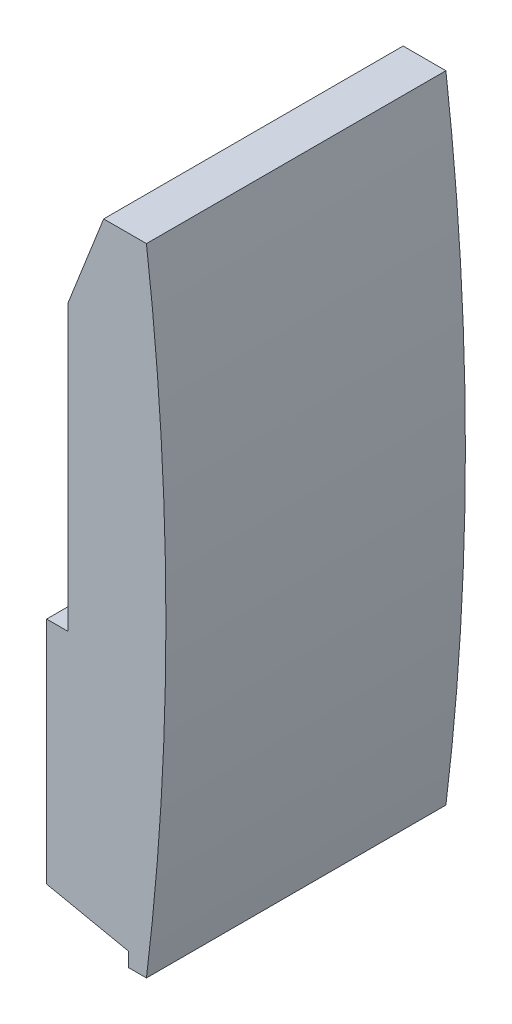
ISO-10303-21;
HEADER;
FILE_DESCRIPTION(('STEP AP214'),'2;1');
FILE_NAME('part.step','',(''),(''),'','','');
FILE_SCHEMA(('AUTOMOTIVE_DESIGN { 1 0 10303 214 1 1 1 1 }'));
ENDSEC;
DATA;
#1=APPLICATION_CONTEXT('core data for automotive mechanical design processes');
#2=APPLICATION_PROTOCOL_DEFINITION('international standard','automotive_design',2000,#1);
#3=PRODUCT_CONTEXT('',#1,'mechanical');
#4=PRODUCT('Part','Part','',(#3));
#5=PRODUCT_RELATED_PRODUCT_CATEGORY('part','',(#4));
#6=PRODUCT_DEFINITION_FORMATION('','',#4);
#7=PRODUCT_DEFINITION_CONTEXT('part definition',#1,'design');
#8=PRODUCT_DEFINITION('design','',#6,#7);
#9=PRODUCT_DEFINITION_SHAPE('','',#8);
#10=(LENGTH_UNIT() NAMED_UNIT(*) SI_UNIT(.MILLI.,.METRE.));
#11=(NAMED_UNIT(*) PLANE_ANGLE_UNIT() SI_UNIT($,.RADIAN.));
#12=(NAMED_UNIT(*) SI_UNIT($,.STERADIAN.) SOLID_ANGLE_UNIT());
#13=UNCERTAINTY_MEASURE_WITH_UNIT(LENGTH_MEASURE(1.E-05),#10,'distance_accuracy_value','');
#14=(GEOMETRIC_REPRESENTATION_CONTEXT(3) GLOBAL_UNCERTAINTY_ASSIGNED_CONTEXT((#13)) GLOBAL_UNIT_ASSIGNED_CONTEXT((#10,
#11,#12)) REPRESENTATION_CONTEXT('',''));
#15=CARTESIAN_POINT('',(0.,0.,0.));
#16=DIRECTION('',(0.,0.,1.));
#17=DIRECTION('',(1.,0.,0.));
#18=AXIS2_PLACEMENT_3D('',#15,#16,#17);
#19=CARTESIAN_POINT('',(349.,-40.2,21.));
#20=DIRECTION('',(1.,0.,0.));
#21=DIRECTION('',(0.,0.,-1.));
#22=AXIS2_PLACEMENT_3D('',#19,#20,#21);
#23=PLANE('',#22);
#24=DIRECTION('',(0.,-1.,0.));
#25=VECTOR('',#24,1.);
#26=CARTESIAN_POINT('',(349.,-40.2,-21.));
#27=LINE('',#26,#25);
#28=CARTESIAN_POINT('',(349.,-8.,-21.));
#29=VERTEX_POINT('',#28);
#30=CARTESIAN_POINT('',(349.,-40.2,-21.));
#31=VERTEX_POINT('',#30);
#32=EDGE_CURVE('E141',#29,#31,#27,.T.);
#33=ORIENTED_EDGE('',*,*,#32,.T.);
#34=DIRECTION('',(0.,0.,-1.));
#35=VECTOR('',#34,1.);
#36=CARTESIAN_POINT('',(349.,-40.2,21.));
#37=LINE('',#36,#35);
#38=CARTESIAN_POINT('',(349.,-40.2,21.));
#39=VERTEX_POINT('',#38);
#40=EDGE_CURVE('E11',#39,#31,#37,.T.);
#41=ORIENTED_EDGE('',*,*,#40,.F.);
#42=DIRECTION('',(0.,-1.,0.));
#43=VECTOR('',#42,1.);
#44=CARTESIAN_POINT('',(349.,-40.2,21.));
#45=LINE('',#44,#43);
#46=CARTESIAN_POINT('',(349.,-8.,21.));
#47=VERTEX_POINT('',#46);
#48=EDGE_CURVE('E157',#47,#39,#45,.T.);
#49=ORIENTED_EDGE('',*,*,#48,.F.);
#50=DIRECTION('',(0.,0.,-1.));
#51=VECTOR('',#50,1.);
#52=CARTESIAN_POINT('',(349.,-8.,21.));
#53=LINE('',#52,#51);
#54=EDGE_CURVE('E137',#47,#29,#53,.T.);
#55=ORIENTED_EDGE('',*,*,#54,.T.);
#56=EDGE_LOOP('',(#33,#41,#49,#55));
#57=FACE_BOUND('',#56,.T.);
#58=ADVANCED_FACE('F39',(#57),#23,.F.);
#59=CARTESIAN_POINT('',(349.,-40.2,21.));
#60=DIRECTION('',(0.204294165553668,0.978909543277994,0.));
#61=DIRECTION('',(-0.978909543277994,0.204294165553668,0.));
#62=AXIS2_PLACEMENT_3D('',#59,#60,#61);
#63=PLANE('',#62);
#64=DIRECTION('',(0.978909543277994,-0.204294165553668,0.));
#65=VECTOR('',#64,1.);
#66=CARTESIAN_POINT('',(349.,-40.2,-21.));
#67=LINE('',#66,#65);
#68=CARTESIAN_POINT('',(360.5,-42.6,-21.));
#69=VERTEX_POINT('',#68);
#70=EDGE_CURVE('E144',#31,#69,#67,.T.);
#71=ORIENTED_EDGE('',*,*,#70,.T.);
#72=DIRECTION('',(0.,0.,-1.));
#73=VECTOR('',#72,1.);
#74=CARTESIAN_POINT('',(360.5,-42.6,21.));
#75=LINE('',#74,#73);
#76=CARTESIAN_POINT('',(360.5,-42.6,21.));
#77=VERTEX_POINT('',#76);
#78=EDGE_CURVE('E47',#77,#69,#75,.T.);
#79=ORIENTED_EDGE('',*,*,#78,.F.);
#80=DIRECTION('',(0.978909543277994,-0.204294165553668,0.));
#81=VECTOR('',#80,1.);
#82=CARTESIAN_POINT('',(349.,-40.2,21.));
#83=LINE('',#82,#81);
#84=EDGE_CURVE('E101',#39,#77,#83,.T.);
#85=ORIENTED_EDGE('',*,*,#84,.F.);
#86=ORIENTED_EDGE('',*,*,#40,.T.);
#87=EDGE_LOOP('',(#71,#79,#85,#86));
#88=FACE_BOUND('',#87,.T.);
#89=ADVANCED_FACE('F200',(#88),#63,.F.);
#90=CARTESIAN_POINT('',(360.5,-42.6,21.));
#91=DIRECTION('',(1.,0.,0.));
#92=DIRECTION('',(0.,0.,-1.));
#93=AXIS2_PLACEMENT_3D('',#90,#91,#92);
#94=PLANE('',#93);
#95=DIRECTION('',(0.,-1.,0.));
#96=VECTOR('',#95,1.);
#97=CARTESIAN_POINT('',(360.5,-42.6,-21.));
#98=LINE('',#97,#96);
#99=CARTESIAN_POINT('',(360.5,-44.6,-21.));
#100=VERTEX_POINT('',#99);
#101=EDGE_CURVE('E146',#69,#100,#98,.T.);
#102=ORIENTED_EDGE('',*,*,#101,.T.);
#103=DIRECTION('',(0.,0.,-1.));
#104=VECTOR('',#103,1.);
#105=CARTESIAN_POINT('',(360.5,-44.6,21.));
#106=LINE('',#105,#104);
#107=CARTESIAN_POINT('',(360.5,-44.6,21.));
#108=VERTEX_POINT('',#107);
#109=EDGE_CURVE('E167',#108,#100,#106,.T.);
#110=ORIENTED_EDGE('',*,*,#109,.F.);
#111=DIRECTION('',(0.,-1.,0.));
#112=VECTOR('',#111,1.);
#113=CARTESIAN_POINT('',(360.5,-42.6,21.));
#114=LINE('',#113,#112);
#115=EDGE_CURVE('E175',#77,#108,#114,.T.);
#116=ORIENTED_EDGE('',*,*,#115,.F.);
#117=ORIENTED_EDGE('',*,*,#78,.T.);
#118=EDGE_LOOP('',(#102,#110,#116,#117));
#119=FACE_BOUND('',#118,.T.);
#120=ADVANCED_FACE('F173',(#119),#94,.F.);
#121=CARTESIAN_POINT('',(360.5,-44.6,21.));
#122=DIRECTION('',(0.,1.,0.));
#123=DIRECTION('',(0.,0.,1.));
#124=AXIS2_PLACEMENT_3D('',#121,#122,#123);
#125=PLANE('',#124);
#126=DIRECTION('',(1.,0.,0.));
#127=VECTOR('',#126,1.);
#128=CARTESIAN_POINT('',(360.5,-44.6,-21.));
#129=LINE('',#128,#127);
#130=CARTESIAN_POINT('',(363.,-44.6,-21.));
#131=VERTEX_POINT('',#130);
#132=EDGE_CURVE('E148',#100,#131,#129,.T.);
#133=ORIENTED_EDGE('',*,*,#132,.T.);
#134=DIRECTION('',(0.,0.,-1.));
#135=VECTOR('',#134,1.);
#136=CARTESIAN_POINT('',(363.,-44.6,21.));
#137=LINE('',#136,#135);
#138=CARTESIAN_POINT('',(363.,-44.6,21.));
#139=VERTEX_POINT('',#138);
#140=EDGE_CURVE('E164',#139,#131,#137,.T.);
#141=ORIENTED_EDGE('',*,*,#140,.F.);
#142=DIRECTION('',(1.,0.,0.));
#143=VECTOR('',#142,1.);
#144=CARTESIAN_POINT('',(360.5,-44.6,21.));
#145=LINE('',#144,#143);
#146=EDGE_CURVE('E191',#108,#139,#145,.T.);
#147=ORIENTED_EDGE('',*,*,#146,.F.);
#148=ORIENTED_EDGE('',*,*,#109,.T.);
#149=EDGE_LOOP('',(#133,#141,#147,#148));
#150=FACE_BOUND('',#149,.T.);
#151=ADVANCED_FACE('F184',(#150),#125,.F.);
#152=CARTESIAN_POINT('',(0.,0.,21.));
#153=DIRECTION('',(0.,0.,-1.));
#154=DIRECTION('',(-1.,0.,0.));
#155=AXIS2_PLACEMENT_3D('',#152,#153,#154);
#156=CYLINDRICAL_SURFACE('',#155,365.729626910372);
#157=CARTESIAN_POINT('',(0.,0.,-21.));
#158=DIRECTION('',(0.,0.,1.));
#159=DIRECTION('',(-1.,0.,0.));
#160=AXIS2_PLACEMENT_3D('',#157,#158,#159);
#161=CIRCLE('',#160,365.729626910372);
#162=CARTESIAN_POINT('',(363.,44.6000000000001,-21.));
#163=VERTEX_POINT('',#162);
#164=EDGE_CURVE('E150',#131,#163,#161,.T.);
#165=ORIENTED_EDGE('',*,*,#164,.T.);
#166=DIRECTION('',(0.,0.,-1.));
#167=VECTOR('',#166,1.);
#168=CARTESIAN_POINT('',(363.,44.6000000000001,21.));
#169=LINE('',#168,#167);
#170=CARTESIAN_POINT('',(363.,44.6000000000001,21.));
#171=VERTEX_POINT('',#170);
#172=EDGE_CURVE('E161',#171,#163,#169,.T.);
#173=ORIENTED_EDGE('',*,*,#172,.F.);
#174=CARTESIAN_POINT('',(0.,0.,21.));
#175=DIRECTION('',(0.,0.,1.));
#176=DIRECTION('',(-1.,0.,0.));
#177=AXIS2_PLACEMENT_3D('',#174,#175,#176);
#178=CIRCLE('',#177,365.729626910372);
#179=EDGE_CURVE('E190',#139,#171,#178,.T.);
#180=ORIENTED_EDGE('',*,*,#179,.F.);
#181=ORIENTED_EDGE('',*,*,#140,.T.);
#182=EDGE_LOOP('',(#165,#173,#180,#181));
#183=FACE_BOUND('',#182,.T.);
#184=ADVANCED_FACE('F188',(#183),#156,.T.);
#185=CARTESIAN_POINT('',(357.,44.6,21.));
#186=DIRECTION('',(0.,-1.,0.));
#187=DIRECTION('',(0.,0.,-1.));
#188=AXIS2_PLACEMENT_3D('',#185,#186,#187);
#189=PLANE('',#188);
#190=DIRECTION('',(-1.,0.,0.));
#191=VECTOR('',#190,1.);
#192=CARTESIAN_POINT('',(357.,44.6,-21.));
#193=LINE('',#192,#191);
#194=CARTESIAN_POINT('',(357.,44.6,-21.));
#195=VERTEX_POINT('',#194);
#196=EDGE_CURVE('E152',#163,#195,#193,.T.);
#197=ORIENTED_EDGE('',*,*,#196,.T.);
#198=DIRECTION('',(0.,0.,-1.));
#199=VECTOR('',#198,1.);
#200=CARTESIAN_POINT('',(357.,44.6,21.));
#201=LINE('',#200,#199);
#202=CARTESIAN_POINT('',(357.,44.6,21.));
#203=VERTEX_POINT('',#202);
#204=EDGE_CURVE('E132',#203,#195,#201,.T.);
#205=ORIENTED_EDGE('',*,*,#204,.F.);
#206=DIRECTION('',(-1.,0.,0.));
#207=VECTOR('',#206,1.);
#208=CARTESIAN_POINT('',(357.,44.6,21.));
#209=LINE('',#208,#207);
#210=EDGE_CURVE('E123',#171,#203,#209,.T.);
#211=ORIENTED_EDGE('',*,*,#210,.F.);
#212=ORIENTED_EDGE('',*,*,#172,.T.);
#213=EDGE_LOOP('',(#197,#205,#211,#212));
#214=FACE_BOUND('',#213,.T.);
#215=ADVANCED_FACE('F212',(#214),#189,.F.);
#216=CARTESIAN_POINT('',(352.,31.9,21.));
#217=DIRECTION('',(0.930484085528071,-0.366332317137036,0.));
#218=DIRECTION('',(0.366332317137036,0.930484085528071,0.));
#219=AXIS2_PLACEMENT_3D('',#216,#217,#218);
#220=PLANE('',#219);
#221=DIRECTION('',(-0.366332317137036,-0.930484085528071,0.));
#222=VECTOR('',#221,1.);
#223=CARTESIAN_POINT('',(352.,31.9,-21.));
#224=LINE('',#223,#222);
#225=CARTESIAN_POINT('',(352.,31.9,-21.));
#226=VERTEX_POINT('',#225);
#227=EDGE_CURVE('E131',#195,#226,#224,.T.);
#228=ORIENTED_EDGE('',*,*,#227,.T.);
#229=DIRECTION('',(0.,0.,-1.));
#230=VECTOR('',#229,1.);
#231=CARTESIAN_POINT('',(352.,31.9,21.));
#232=LINE('',#231,#230);
#233=CARTESIAN_POINT('',(352.,31.9,21.));
#234=VERTEX_POINT('',#233);
#235=EDGE_CURVE('E128',#234,#226,#232,.T.);
#236=ORIENTED_EDGE('',*,*,#235,.F.);
#237=DIRECTION('',(-0.366332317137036,-0.930484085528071,0.));
#238=VECTOR('',#237,1.);
#239=CARTESIAN_POINT('',(352.,31.9,21.));
#240=LINE('',#239,#238);
#241=EDGE_CURVE('E117',#203,#234,#240,.T.);
#242=ORIENTED_EDGE('',*,*,#241,.F.);
#243=ORIENTED_EDGE('',*,*,#204,.T.);
#244=EDGE_LOOP('',(#228,#236,#242,#243));
#245=FACE_BOUND('',#244,.T.);
#246=ADVANCED_FACE('F129',(#245),#220,.F.);
#247=CARTESIAN_POINT('',(352.,-8.,21.));
#248=DIRECTION('',(1.,0.,0.));
#249=DIRECTION('',(0.,0.,-1.));
#250=AXIS2_PLACEMENT_3D('',#247,#248,#249);
#251=PLANE('',#250);
#252=DIRECTION('',(0.,-1.,0.));
#253=VECTOR('',#252,1.);
#254=CARTESIAN_POINT('',(352.,-8.,-21.));
#255=LINE('',#254,#253);
#256=CARTESIAN_POINT('',(352.,-8.,-21.));
#257=VERTEX_POINT('',#256);
#258=EDGE_CURVE('E87',#226,#257,#255,.T.);
#259=ORIENTED_EDGE('',*,*,#258,.T.);
#260=DIRECTION('',(0.,0.,-1.));
#261=VECTOR('',#260,1.);
#262=CARTESIAN_POINT('',(352.,-8.,21.));
#263=LINE('',#262,#261);
#264=CARTESIAN_POINT('',(352.,-8.,21.));
#265=VERTEX_POINT('',#264);
#266=EDGE_CURVE('E133',#265,#257,#263,.T.);
#267=ORIENTED_EDGE('',*,*,#266,.F.);
#268=DIRECTION('',(0.,-1.,0.));
#269=VECTOR('',#268,1.);
#270=CARTESIAN_POINT('',(352.,-8.,21.));
#271=LINE('',#270,#269);
#272=EDGE_CURVE('E121',#234,#265,#271,.T.);
#273=ORIENTED_EDGE('',*,*,#272,.F.);
#274=ORIENTED_EDGE('',*,*,#235,.T.);
#275=EDGE_LOOP('',(#259,#267,#273,#274));
#276=FACE_BOUND('',#275,.T.);
#277=ADVANCED_FACE('F135',(#276),#251,.F.);
#278=CARTESIAN_POINT('',(349.,-8.,21.));
#279=DIRECTION('',(0.,-1.,0.));
#280=DIRECTION('',(0.,0.,-1.));
#281=AXIS2_PLACEMENT_3D('',#278,#279,#280);
#282=PLANE('',#281);
#283=DIRECTION('',(-1.,0.,0.));
#284=VECTOR('',#283,1.);
#285=CARTESIAN_POINT('',(349.,-8.,-21.));
#286=LINE('',#285,#284);
#287=EDGE_CURVE('E93',#257,#29,#286,.T.);
#288=ORIENTED_EDGE('',*,*,#287,.T.);
#289=ORIENTED_EDGE('',*,*,#54,.F.);
#290=DIRECTION('',(-1.,0.,0.));
#291=VECTOR('',#290,1.);
#292=CARTESIAN_POINT('',(349.,-8.,21.));
#293=LINE('',#292,#291);
#294=EDGE_CURVE('E55',#265,#47,#293,.T.);
#295=ORIENTED_EDGE('',*,*,#294,.F.);
#296=ORIENTED_EDGE('',*,*,#266,.T.);
#297=EDGE_LOOP('',(#288,#289,#295,#296));
#298=FACE_BOUND('',#297,.T.);
#299=ADVANCED_FACE('F220',(#298),#282,.F.);
#300=CARTESIAN_POINT('',(0.,0.,21.));
#301=DIRECTION('',(0.,0.,-1.));
#302=DIRECTION('',(-1.,0.,0.));
#303=AXIS2_PLACEMENT_3D('',#300,#301,#302);
#304=PLANE('',#303);
#305=ORIENTED_EDGE('',*,*,#48,.T.);
#306=ORIENTED_EDGE('',*,*,#84,.T.);
#307=ORIENTED_EDGE('',*,*,#115,.T.);
#308=ORIENTED_EDGE('',*,*,#146,.T.);
#309=ORIENTED_EDGE('',*,*,#179,.T.);
#310=ORIENTED_EDGE('',*,*,#210,.T.);
#311=ORIENTED_EDGE('',*,*,#241,.T.);
#312=ORIENTED_EDGE('',*,*,#272,.T.);
#313=ORIENTED_EDGE('',*,*,#294,.T.);
#314=EDGE_LOOP('',(#305,#306,#307,#308,#309,#310,#311,#312,#313));
#315=FACE_BOUND('',#314,.T.);
#316=ADVANCED_FACE('F119',(#315),#304,.F.);
#317=CARTESIAN_POINT('',(0.,0.,-21.));
#318=DIRECTION('',(0.,0.,-1.));
#319=DIRECTION('',(-1.,0.,0.));
#320=AXIS2_PLACEMENT_3D('',#317,#318,#319);
#321=PLANE('',#320);
#322=ORIENTED_EDGE('',*,*,#32,.F.);
#323=ORIENTED_EDGE('',*,*,#287,.F.);
#324=ORIENTED_EDGE('',*,*,#258,.F.);
#325=ORIENTED_EDGE('',*,*,#227,.F.);
#326=ORIENTED_EDGE('',*,*,#196,.F.);
#327=ORIENTED_EDGE('',*,*,#164,.F.);
#328=ORIENTED_EDGE('',*,*,#132,.F.);
#329=ORIENTED_EDGE('',*,*,#101,.F.);
#330=ORIENTED_EDGE('',*,*,#70,.F.);
#331=EDGE_LOOP('',(#322,#323,#324,#325,#326,#327,#328,#329,#330));
#332=FACE_BOUND('',#331,.T.);
#333=ADVANCED_FACE('F179',(#332),#321,.T.);
#334=CLOSED_SHELL('',(#58,#89,#120,#151,#184,#215,#246,#277,#299,#316,#333));
#335=MANIFOLD_SOLID_BREP('B2',#334);
#336=ADVANCED_BREP_SHAPE_REPRESENTATION('',(#18,#335),#14);
#337=SHAPE_DEFINITION_REPRESENTATION(#9,#336);
ENDSEC;
END-ISO-10303-21;
